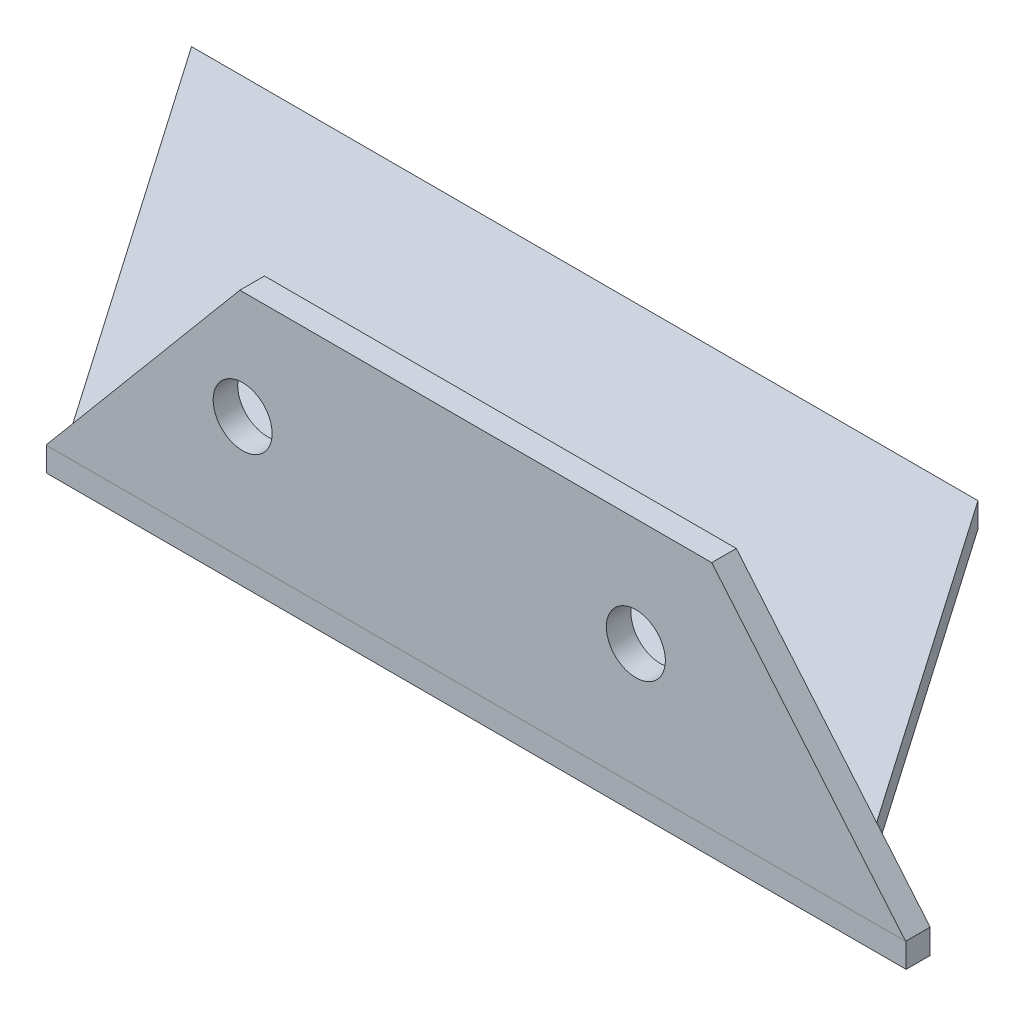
from build123d import *

# Parameters (mm, degrees)
BOSS_EXTRUDE1_DEPTH = 3.175
MT_FLANGE_DEPTH     = 3.175
SKETCH4_R           = 3.81
HOLES_DEPTH         = 167.188871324
BOSS_EXTRUDE2_DEPTH = 3.175
SKETCH7_W           = 164.914879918
SKETCH7_H           = 50.867683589
ORIG_SIDE_DEPTH     = 189.371029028


with BuildPart() as part:
    # Sketch1 → Boss-Extrude1 (new body)
    with BuildSketch(Plane(origin=(0, 0, 0), x_dir=(1, 0, 0), z_dir=(0, 1, 0))):
        Polygon((0, 0), (42.626261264, 50.8), (144.226261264, 50.8), (101.6, 0), align=None)
    extrude(amount=BOSS_EXTRUDE1_DEPTH)

    # Sketch3 → mt flange (add)
    with BuildSketch(Plane(origin=(0, 0, -50.8), x_dir=(-1, 0, 0), z_dir=(0, 0, -1))):
        Polygon((-42.626261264, 3.175), (-67.669189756, 33.02), (-128.629189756, 33.02), (-153.672118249, 3.175), (-153.672118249, 0), (-42.626261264, 0), align=None)
    extrude(amount=MT_FLANGE_DEPTH)

    # Sketch4 → holes (cut, through all)
    with BuildSketch(Plane(origin=(0, 0, -53.975), x_dir=(-1, 0, 0), z_dir=(0, 0, -1))):
        with Locations((-68.026261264, 19.05)):
            Circle(SKETCH4_R)
        with Locations((-118.826261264, 19.05)):
            Circle(SKETCH4_R)
    extrude(amount=-HOLES_DEPTH, mode=Mode.SUBTRACT)

    # Sketch5 → Boss-Extrude2 (add)
    with BuildSketch(Plane(origin=(0, 0, 0), x_dir=(1, 0, 0), z_dir=(0, 1, 0))):
        Polygon((42.626261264, 53.975), (7.450673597, 104.775), (109.050673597, 104.775), (144.226261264, 53.975), align=None)
    extrude(amount=BOSS_EXTRUDE2_DEPTH)

    # Sketch7 → orig side (cut, through all)
    with BuildSketch(Plane(origin=(0, 3.175, 0), x_dir=(1, 0, 0), z_dir=(0, 1, 0))):
        with Locations((76.355926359, 25.433841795)):
            Rectangle(SKETCH7_W, SKETCH7_H)
    extrude(amount=-ORIG_SIDE_DEPTH, mode=Mode.SUBTRACT)


solid = part.part
